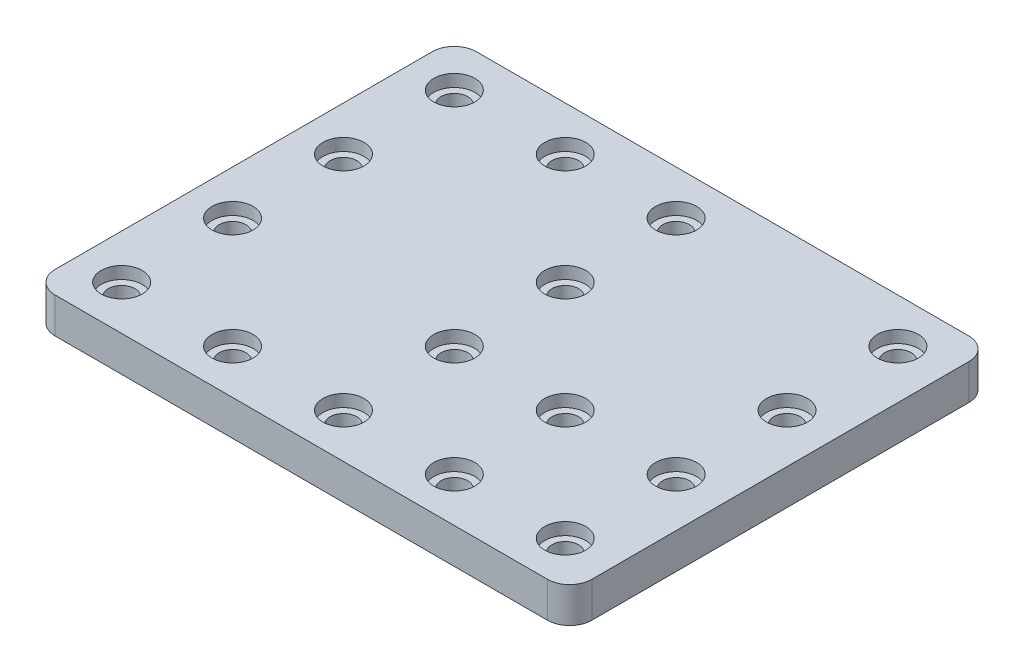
from build123d import *

# Parameters (mm, degrees)
EXTRUDE1_DEPTH                   = 16
CBORE_FOR_M10_SBHCS1_D           = 12
CBORE_FOR_M10_SBHCS1_CBORE_D     = 18.5
CBORE_FOR_M10_SBHCS1_CBORE_DEPTH = 5.5
LPATTERN2_COUNT                  = 4
LPATTERN2_PITCH                  = 50
LPATTERN2_COUNT_DIR2             = 5
LPATTERN2_PITCH_DIR2             = 50


with BuildPart() as part:
    # Sketch1 → Extrude1 (new body)
    with BuildSketch(Plane(origin=(0, 0, 0), x_dir=(1, 0, 0), z_dir=(0, 1, 0))):
        with BuildLine():
            Line((10, 0), (232, 0))
            ThreePointArc((232, 0), (239.071067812, 2.928932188), (242, 10))
            Line((242, 10), (242, 180))
            ThreePointArc((242, 180), (239.071067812, 187.071067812), (232, 190))
            Line((232, 190), (10, 190))
            ThreePointArc((10, 190), (2.928932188, 187.071067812), (0, 180))
            Line((0, 180), (0, 10))
            ThreePointArc((0, 10), (2.928932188, 2.928932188), (10, 0))
        make_face()
    extrude(amount=EXTRUDE1_DEPTH)

    # CBORE for M10 SBHCS1 (through all)
    with Locations(Plane(origin=(0, 16, 0), x_dir=(-1, 0, 0), z_dir=(0, 1, 0))):
        with Locations((-20, -20)):
            cbore_for_m10_sbhcs1 = CounterBoreHole(CBORE_FOR_M10_SBHCS1_D / 2, CBORE_FOR_M10_SBHCS1_CBORE_D / 2, CBORE_FOR_M10_SBHCS1_CBORE_DEPTH)

    # LPattern2: CBORE for M10 SBHCS1 4 × 5, 4 skipped
    with Locations(*[(j * LPATTERN2_PITCH_DIR2, 0, -i * LPATTERN2_PITCH) for i in range(LPATTERN2_COUNT) for j in range(LPATTERN2_COUNT_DIR2) if (i, j) not in ((0, 0), (1, 1), (2, 1), (2, 3), (3, 3))]):
        add(cbore_for_m10_sbhcs1, mode=Mode.SUBTRACT)


solid = part.part
